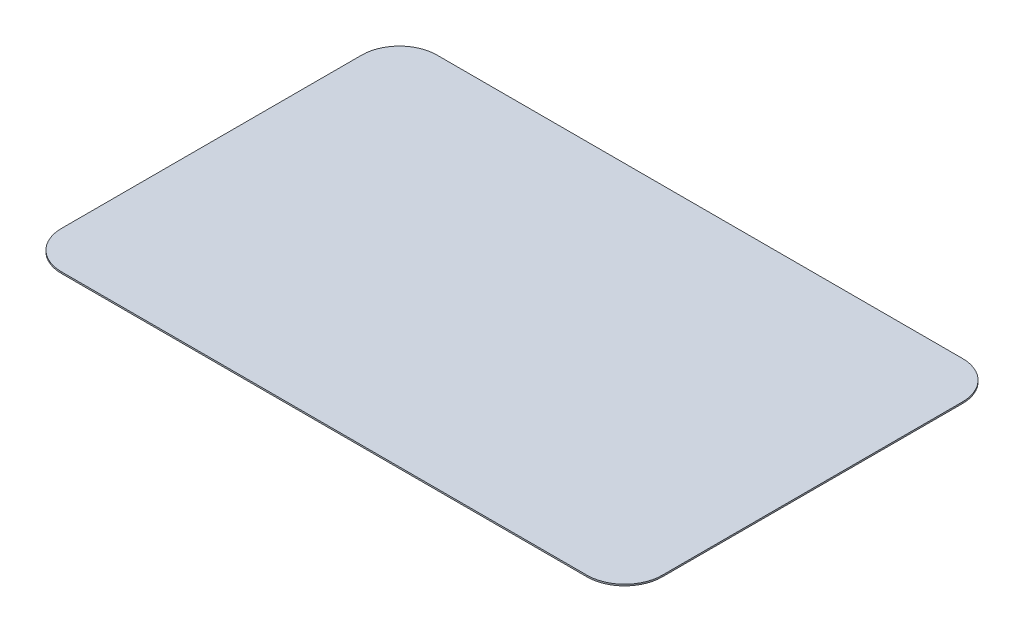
ISO-10303-21;
HEADER;
FILE_DESCRIPTION(('STEP AP214'),'2;1');
FILE_NAME('part.step','',(''),(''),'','','');
FILE_SCHEMA(('AUTOMOTIVE_DESIGN { 1 0 10303 214 1 1 1 1 }'));
ENDSEC;
DATA;
#1=APPLICATION_CONTEXT('core data for automotive mechanical design processes');
#2=APPLICATION_PROTOCOL_DEFINITION('international standard','automotive_design',2000,#1);
#3=PRODUCT_CONTEXT('',#1,'mechanical');
#4=PRODUCT('Part','Part','',(#3));
#5=PRODUCT_RELATED_PRODUCT_CATEGORY('part','',(#4));
#6=PRODUCT_DEFINITION_FORMATION('','',#4);
#7=PRODUCT_DEFINITION_CONTEXT('part definition',#1,'design');
#8=PRODUCT_DEFINITION('design','',#6,#7);
#9=PRODUCT_DEFINITION_SHAPE('','',#8);
#10=(LENGTH_UNIT() NAMED_UNIT(*) SI_UNIT(.MILLI.,.METRE.));
#11=(NAMED_UNIT(*) PLANE_ANGLE_UNIT() SI_UNIT($,.RADIAN.));
#12=(NAMED_UNIT(*) SI_UNIT($,.STERADIAN.) SOLID_ANGLE_UNIT());
#13=UNCERTAINTY_MEASURE_WITH_UNIT(LENGTH_MEASURE(1.E-05),#10,'distance_accuracy_value','');
#14=(GEOMETRIC_REPRESENTATION_CONTEXT(3) GLOBAL_UNCERTAINTY_ASSIGNED_CONTEXT((#13)) GLOBAL_UNIT_ASSIGNED_CONTEXT((#10,
#11,#12)) REPRESENTATION_CONTEXT('',''));
#15=CARTESIAN_POINT('',(0.,0.,0.));
#16=DIRECTION('',(0.,0.,1.));
#17=DIRECTION('',(1.,0.,0.));
#18=AXIS2_PLACEMENT_3D('',#15,#16,#17);
#19=CARTESIAN_POINT('',(-22.225,0.127,12.7));
#20=DIRECTION('',(0.,-1.,0.));
#21=DIRECTION('',(0.,0.,-1.));
#22=AXIS2_PLACEMENT_3D('',#19,#20,#21);
#23=CYLINDRICAL_SURFACE('',#22,3.175);
#24=CARTESIAN_POINT('',(-22.225,0.127,12.7));
#25=DIRECTION('',(0.,1.,0.));
#26=DIRECTION('',(0.,0.,1.));
#27=AXIS2_PLACEMENT_3D('',#24,#25,#26);
#28=CIRCLE('',#27,3.175);
#29=CARTESIAN_POINT('',(-25.4,0.127,12.7));
#30=VERTEX_POINT('',#29);
#31=CARTESIAN_POINT('',(-22.225,0.127,15.875));
#32=VERTEX_POINT('',#31);
#33=EDGE_CURVE('E145',#30,#32,#28,.T.);
#34=ORIENTED_EDGE('',*,*,#33,.F.);
#35=DIRECTION('',(0.,1.,0.));
#36=VECTOR('',#35,1.);
#37=CARTESIAN_POINT('',(-25.4,0.127,12.7));
#38=LINE('',#37,#36);
#39=CARTESIAN_POINT('',(-25.4,0.,12.7));
#40=VERTEX_POINT('',#39);
#41=EDGE_CURVE('E179',#40,#30,#38,.T.);
#42=ORIENTED_EDGE('',*,*,#41,.F.);
#43=CARTESIAN_POINT('',(-22.225,0.,12.7));
#44=DIRECTION('',(0.,-1.,0.));
#45=DIRECTION('',(0.,0.,1.));
#46=AXIS2_PLACEMENT_3D('',#43,#44,#45);
#47=CIRCLE('',#46,3.175);
#48=CARTESIAN_POINT('',(-22.225,0.,15.875));
#49=VERTEX_POINT('',#48);
#50=EDGE_CURVE('E11',#49,#40,#47,.T.);
#51=ORIENTED_EDGE('',*,*,#50,.F.);
#52=DIRECTION('',(0.,-1.,0.));
#53=VECTOR('',#52,1.);
#54=CARTESIAN_POINT('',(-22.225,0.127,15.875));
#55=LINE('',#54,#53);
#56=EDGE_CURVE('E132',#32,#49,#55,.T.);
#57=ORIENTED_EDGE('',*,*,#56,.F.);
#58=EDGE_LOOP('',(#34,#42,#51,#57));
#59=FACE_BOUND('',#58,.T.);
#60=ADVANCED_FACE('F17',(#59),#23,.T.);
#61=CARTESIAN_POINT('',(22.225,0.127,12.7));
#62=DIRECTION('',(0.,-1.,0.));
#63=DIRECTION('',(0.,0.,-1.));
#64=AXIS2_PLACEMENT_3D('',#61,#62,#63);
#65=CYLINDRICAL_SURFACE('',#64,3.175);
#66=CARTESIAN_POINT('',(22.225,0.127,12.7));
#67=DIRECTION('',(0.,1.,0.));
#68=DIRECTION('',(0.,0.,1.));
#69=AXIS2_PLACEMENT_3D('',#66,#67,#68);
#70=CIRCLE('',#69,3.175);
#71=CARTESIAN_POINT('',(22.225,0.127,15.875));
#72=VERTEX_POINT('',#71);
#73=CARTESIAN_POINT('',(25.4,0.127,12.7));
#74=VERTEX_POINT('',#73);
#75=EDGE_CURVE('E110',#72,#74,#70,.T.);
#76=ORIENTED_EDGE('',*,*,#75,.F.);
#77=DIRECTION('',(0.,1.,0.));
#78=VECTOR('',#77,1.);
#79=CARTESIAN_POINT('',(22.225,0.127,15.875));
#80=LINE('',#79,#78);
#81=CARTESIAN_POINT('',(22.225,0.,15.875));
#82=VERTEX_POINT('',#81);
#83=EDGE_CURVE('E169',#82,#72,#80,.T.);
#84=ORIENTED_EDGE('',*,*,#83,.F.);
#85=CARTESIAN_POINT('',(22.225,0.,12.7));
#86=DIRECTION('',(0.,-1.,0.));
#87=DIRECTION('',(0.,0.,1.));
#88=AXIS2_PLACEMENT_3D('',#85,#86,#87);
#89=CIRCLE('',#88,3.175);
#90=CARTESIAN_POINT('',(25.4,0.,12.7));
#91=VERTEX_POINT('',#90);
#92=EDGE_CURVE('E21',#91,#82,#89,.T.);
#93=ORIENTED_EDGE('',*,*,#92,.F.);
#94=DIRECTION('',(0.,-1.,0.));
#95=VECTOR('',#94,1.);
#96=CARTESIAN_POINT('',(25.4,0.127,12.7));
#97=LINE('',#96,#95);
#98=EDGE_CURVE('E120',#74,#91,#97,.T.);
#99=ORIENTED_EDGE('',*,*,#98,.F.);
#100=EDGE_LOOP('',(#76,#84,#93,#99));
#101=FACE_BOUND('',#100,.T.);
#102=ADVANCED_FACE('F19',(#101),#65,.T.);
#103=CARTESIAN_POINT('',(22.225,0.127,-12.7));
#104=DIRECTION('',(0.,-1.,0.));
#105=DIRECTION('',(0.,0.,-1.));
#106=AXIS2_PLACEMENT_3D('',#103,#104,#105);
#107=CYLINDRICAL_SURFACE('',#106,3.175);
#108=CARTESIAN_POINT('',(22.225,0.127,-12.7));
#109=DIRECTION('',(0.,1.,0.));
#110=DIRECTION('',(0.,0.,1.));
#111=AXIS2_PLACEMENT_3D('',#108,#109,#110);
#112=CIRCLE('',#111,3.175);
#113=CARTESIAN_POINT('',(25.4,0.127,-12.7));
#114=VERTEX_POINT('',#113);
#115=CARTESIAN_POINT('',(22.225,0.127,-15.875));
#116=VERTEX_POINT('',#115);
#117=EDGE_CURVE('E40',#114,#116,#112,.T.);
#118=ORIENTED_EDGE('',*,*,#117,.F.);
#119=DIRECTION('',(0.,1.,0.));
#120=VECTOR('',#119,1.);
#121=CARTESIAN_POINT('',(25.4,0.127,-12.7));
#122=LINE('',#121,#120);
#123=CARTESIAN_POINT('',(25.4,0.,-12.7));
#124=VERTEX_POINT('',#123);
#125=EDGE_CURVE('E103',#124,#114,#122,.T.);
#126=ORIENTED_EDGE('',*,*,#125,.F.);
#127=CARTESIAN_POINT('',(22.225,0.,-12.7));
#128=DIRECTION('',(0.,-1.,0.));
#129=DIRECTION('',(0.,0.,1.));
#130=AXIS2_PLACEMENT_3D('',#127,#128,#129);
#131=CIRCLE('',#130,3.175);
#132=CARTESIAN_POINT('',(22.225,0.,-15.875));
#133=VERTEX_POINT('',#132);
#134=EDGE_CURVE('E151',#133,#124,#131,.T.);
#135=ORIENTED_EDGE('',*,*,#134,.F.);
#136=DIRECTION('',(0.,-1.,0.));
#137=VECTOR('',#136,1.);
#138=CARTESIAN_POINT('',(22.225,0.127,-15.875));
#139=LINE('',#138,#137);
#140=EDGE_CURVE('E106',#116,#133,#139,.T.);
#141=ORIENTED_EDGE('',*,*,#140,.F.);
#142=EDGE_LOOP('',(#118,#126,#135,#141));
#143=FACE_BOUND('',#142,.T.);
#144=ADVANCED_FACE('F100',(#143),#107,.T.);
#145=CARTESIAN_POINT('',(-22.225,0.127,-12.7));
#146=DIRECTION('',(0.,-1.,0.));
#147=DIRECTION('',(0.,0.,-1.));
#148=AXIS2_PLACEMENT_3D('',#145,#146,#147);
#149=CYLINDRICAL_SURFACE('',#148,3.175);
#150=CARTESIAN_POINT('',(-22.225,0.127,-12.7));
#151=DIRECTION('',(0.,1.,0.));
#152=DIRECTION('',(0.,0.,1.));
#153=AXIS2_PLACEMENT_3D('',#150,#151,#152);
#154=CIRCLE('',#153,3.175);
#155=CARTESIAN_POINT('',(-22.225,0.127,-15.875));
#156=VERTEX_POINT('',#155);
#157=CARTESIAN_POINT('',(-25.4,0.127,-12.7));
#158=VERTEX_POINT('',#157);
#159=EDGE_CURVE('E54',#156,#158,#154,.T.);
#160=ORIENTED_EDGE('',*,*,#159,.F.);
#161=DIRECTION('',(0.,1.,0.));
#162=VECTOR('',#161,1.);
#163=CARTESIAN_POINT('',(-22.225,0.127,-15.875));
#164=LINE('',#163,#162);
#165=CARTESIAN_POINT('',(-22.225,0.,-15.875));
#166=VERTEX_POINT('',#165);
#167=EDGE_CURVE('E137',#166,#156,#164,.T.);
#168=ORIENTED_EDGE('',*,*,#167,.F.);
#169=CARTESIAN_POINT('',(-22.225,0.,-12.7));
#170=DIRECTION('',(0.,-1.,0.));
#171=DIRECTION('',(0.,0.,1.));
#172=AXIS2_PLACEMENT_3D('',#169,#170,#171);
#173=CIRCLE('',#172,3.175);
#174=CARTESIAN_POINT('',(-25.4,0.,-12.7));
#175=VERTEX_POINT('',#174);
#176=EDGE_CURVE('E109',#175,#166,#173,.T.);
#177=ORIENTED_EDGE('',*,*,#176,.F.);
#178=DIRECTION('',(0.,-1.,0.));
#179=VECTOR('',#178,1.);
#180=CARTESIAN_POINT('',(-25.4,0.127,-12.7));
#181=LINE('',#180,#179);
#182=EDGE_CURVE('E199',#158,#175,#181,.T.);
#183=ORIENTED_EDGE('',*,*,#182,.F.);
#184=EDGE_LOOP('',(#160,#168,#177,#183));
#185=FACE_BOUND('',#184,.T.);
#186=ADVANCED_FACE('F224',(#185),#149,.T.);
#187=CARTESIAN_POINT('',(0.,0.,0.));
#188=DIRECTION('',(0.,1.,0.));
#189=DIRECTION('',(1.,0.,0.));
#190=AXIS2_PLACEMENT_3D('',#187,#188,#189);
#191=PLANE('',#190);
#192=DIRECTION('',(0.,0.,1.));
#193=VECTOR('',#192,1.);
#194=CARTESIAN_POINT('',(-25.4,0.,15.875));
#195=LINE('',#194,#193);
#196=EDGE_CURVE('E185',#175,#40,#195,.T.);
#197=ORIENTED_EDGE('',*,*,#196,.F.);
#198=ORIENTED_EDGE('',*,*,#176,.T.);
#199=DIRECTION('',(-1.,0.,0.));
#200=VECTOR('',#199,1.);
#201=CARTESIAN_POINT('',(25.4,0.,-15.875));
#202=LINE('',#201,#200);
#203=EDGE_CURVE('E136',#133,#166,#202,.T.);
#204=ORIENTED_EDGE('',*,*,#203,.F.);
#205=ORIENTED_EDGE('',*,*,#134,.T.);
#206=DIRECTION('',(0.,0.,-1.));
#207=VECTOR('',#206,1.);
#208=CARTESIAN_POINT('',(25.4,0.,15.875));
#209=LINE('',#208,#207);
#210=EDGE_CURVE('E124',#91,#124,#209,.T.);
#211=ORIENTED_EDGE('',*,*,#210,.F.);
#212=ORIENTED_EDGE('',*,*,#92,.T.);
#213=DIRECTION('',(1.,0.,0.));
#214=VECTOR('',#213,1.);
#215=CARTESIAN_POINT('',(25.4,0.,15.875));
#216=LINE('',#215,#214);
#217=EDGE_CURVE('E166',#49,#82,#216,.T.);
#218=ORIENTED_EDGE('',*,*,#217,.F.);
#219=ORIENTED_EDGE('',*,*,#50,.T.);
#220=EDGE_LOOP('',(#197,#198,#204,#205,#211,#212,#218,#219));
#221=FACE_BOUND('',#220,.T.);
#222=ADVANCED_FACE('F164',(#221),#191,.F.);
#223=CARTESIAN_POINT('',(0.,0.127,0.));
#224=DIRECTION('',(0.,1.,0.));
#225=DIRECTION('',(1.,0.,0.));
#226=AXIS2_PLACEMENT_3D('',#223,#224,#225);
#227=PLANE('',#226);
#228=DIRECTION('',(-1.,0.,0.));
#229=VECTOR('',#228,1.);
#230=CARTESIAN_POINT('',(25.4,0.127,-15.875));
#231=LINE('',#230,#229);
#232=EDGE_CURVE('E140',#116,#156,#231,.T.);
#233=ORIENTED_EDGE('',*,*,#232,.T.);
#234=ORIENTED_EDGE('',*,*,#159,.T.);
#235=DIRECTION('',(0.,0.,1.));
#236=VECTOR('',#235,1.);
#237=CARTESIAN_POINT('',(-25.4,0.127,15.875));
#238=LINE('',#237,#236);
#239=EDGE_CURVE('E206',#158,#30,#238,.T.);
#240=ORIENTED_EDGE('',*,*,#239,.T.);
#241=ORIENTED_EDGE('',*,*,#33,.T.);
#242=DIRECTION('',(1.,0.,0.));
#243=VECTOR('',#242,1.);
#244=CARTESIAN_POINT('',(25.4,0.127,15.875));
#245=LINE('',#244,#243);
#246=EDGE_CURVE('E173',#32,#72,#245,.T.);
#247=ORIENTED_EDGE('',*,*,#246,.T.);
#248=ORIENTED_EDGE('',*,*,#75,.T.);
#249=DIRECTION('',(0.,0.,-1.));
#250=VECTOR('',#249,1.);
#251=CARTESIAN_POINT('',(25.4,0.127,15.875));
#252=LINE('',#251,#250);
#253=EDGE_CURVE('E113',#74,#114,#252,.T.);
#254=ORIENTED_EDGE('',*,*,#253,.T.);
#255=ORIENTED_EDGE('',*,*,#117,.T.);
#256=EDGE_LOOP('',(#233,#234,#240,#241,#247,#248,#254,#255));
#257=FACE_BOUND('',#256,.T.);
#258=ADVANCED_FACE('F114',(#257),#227,.T.);
#259=CARTESIAN_POINT('',(25.4,0.127,-15.875));
#260=DIRECTION('',(0.,0.,1.));
#261=DIRECTION('',(1.,0.,0.));
#262=AXIS2_PLACEMENT_3D('',#259,#260,#261);
#263=PLANE('',#262);
#264=ORIENTED_EDGE('',*,*,#203,.T.);
#265=ORIENTED_EDGE('',*,*,#167,.T.);
#266=ORIENTED_EDGE('',*,*,#232,.F.);
#267=ORIENTED_EDGE('',*,*,#140,.T.);
#268=EDGE_LOOP('',(#264,#265,#266,#267));
#269=FACE_BOUND('',#268,.T.);
#270=ADVANCED_FACE('F223',(#269),#263,.F.);
#271=CARTESIAN_POINT('',(25.4,0.127,15.875));
#272=DIRECTION('',(-1.,0.,0.));
#273=DIRECTION('',(0.,0.,1.));
#274=AXIS2_PLACEMENT_3D('',#271,#272,#273);
#275=PLANE('',#274);
#276=ORIENTED_EDGE('',*,*,#210,.T.);
#277=ORIENTED_EDGE('',*,*,#125,.T.);
#278=ORIENTED_EDGE('',*,*,#253,.F.);
#279=ORIENTED_EDGE('',*,*,#98,.T.);
#280=EDGE_LOOP('',(#276,#277,#278,#279));
#281=FACE_BOUND('',#280,.T.);
#282=ADVANCED_FACE('F122',(#281),#275,.F.);
#283=CARTESIAN_POINT('',(25.4,0.127,15.875));
#284=DIRECTION('',(0.,0.,-1.));
#285=DIRECTION('',(-1.,0.,0.));
#286=AXIS2_PLACEMENT_3D('',#283,#284,#285);
#287=PLANE('',#286);
#288=ORIENTED_EDGE('',*,*,#217,.T.);
#289=ORIENTED_EDGE('',*,*,#83,.T.);
#290=ORIENTED_EDGE('',*,*,#246,.F.);
#291=ORIENTED_EDGE('',*,*,#56,.T.);
#292=EDGE_LOOP('',(#288,#289,#290,#291));
#293=FACE_BOUND('',#292,.T.);
#294=ADVANCED_FACE('F176',(#293),#287,.F.);
#295=CARTESIAN_POINT('',(-25.4,0.127,15.875));
#296=DIRECTION('',(1.,0.,0.));
#297=DIRECTION('',(0.,1.,0.));
#298=AXIS2_PLACEMENT_3D('',#295,#296,#297);
#299=PLANE('',#298);
#300=ORIENTED_EDGE('',*,*,#239,.F.);
#301=ORIENTED_EDGE('',*,*,#182,.T.);
#302=ORIENTED_EDGE('',*,*,#196,.T.);
#303=ORIENTED_EDGE('',*,*,#41,.T.);
#304=EDGE_LOOP('',(#300,#301,#302,#303));
#305=FACE_BOUND('',#304,.T.);
#306=ADVANCED_FACE('F228',(#305),#299,.F.);
#307=CLOSED_SHELL('',(#60,#102,#144,#186,#222,#258,#270,#282,#294,#306));
#308=MANIFOLD_SOLID_BREP('B1',#307);
#309=ADVANCED_BREP_SHAPE_REPRESENTATION('',(#18,#308),#14);
#310=SHAPE_DEFINITION_REPRESENTATION(#9,#309);
ENDSEC;
END-ISO-10303-21;
